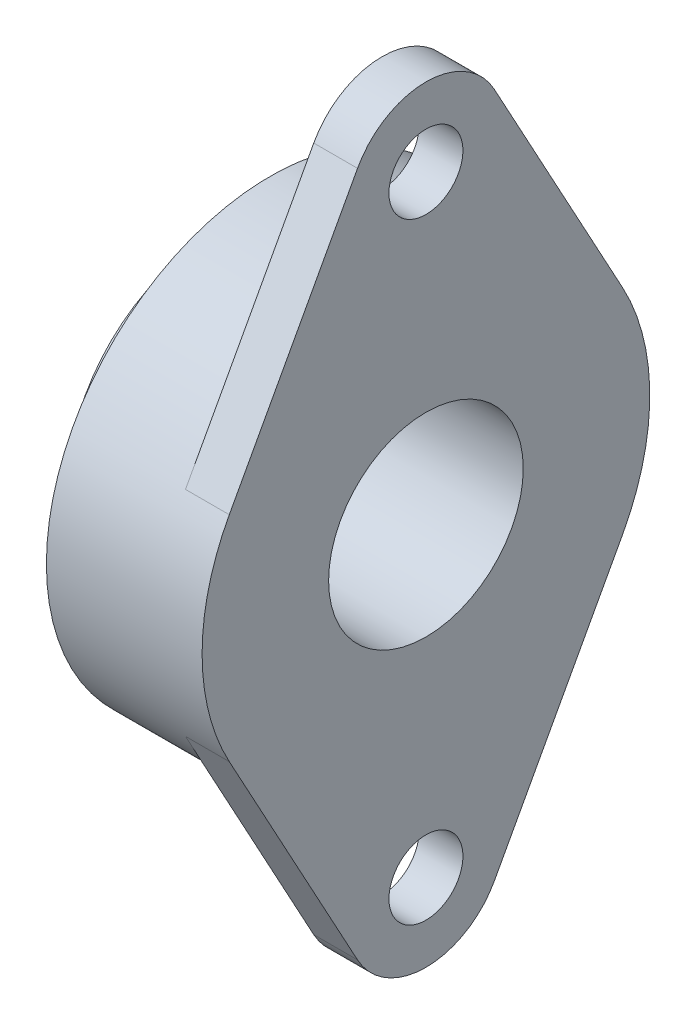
ISO-10303-21;
HEADER;
FILE_DESCRIPTION(('STEP AP214'),'2;1');
FILE_NAME('part.step','',(''),(''),'','','');
FILE_SCHEMA(('AUTOMOTIVE_DESIGN { 1 0 10303 214 1 1 1 1 }'));
ENDSEC;
DATA;
#1=APPLICATION_CONTEXT('core data for automotive mechanical design processes');
#2=APPLICATION_PROTOCOL_DEFINITION('international standard','automotive_design',2000,#1);
#3=PRODUCT_CONTEXT('',#1,'mechanical');
#4=PRODUCT('Part','Part','',(#3));
#5=PRODUCT_RELATED_PRODUCT_CATEGORY('part','',(#4));
#6=PRODUCT_DEFINITION_FORMATION('','',#4);
#7=PRODUCT_DEFINITION_CONTEXT('part definition',#1,'design');
#8=PRODUCT_DEFINITION('design','',#6,#7);
#9=PRODUCT_DEFINITION_SHAPE('','',#8);
#10=(LENGTH_UNIT() NAMED_UNIT(*) SI_UNIT(.MILLI.,.METRE.));
#11=(NAMED_UNIT(*) PLANE_ANGLE_UNIT() SI_UNIT($,.RADIAN.));
#12=(NAMED_UNIT(*) SI_UNIT($,.STERADIAN.) SOLID_ANGLE_UNIT());
#13=UNCERTAINTY_MEASURE_WITH_UNIT(LENGTH_MEASURE(1.E-05),#10,'distance_accuracy_value','');
#14=(GEOMETRIC_REPRESENTATION_CONTEXT(3) GLOBAL_UNCERTAINTY_ASSIGNED_CONTEXT((#13)) GLOBAL_UNIT_ASSIGNED_CONTEXT((#10,
#11,#12)) REPRESENTATION_CONTEXT('',''));
#15=CARTESIAN_POINT('',(0.,0.,0.));
#16=DIRECTION('',(0.,0.,1.));
#17=DIRECTION('',(1.,0.,0.));
#18=AXIS2_PLACEMENT_3D('',#15,#16,#17);
#19=CARTESIAN_POINT('',(-11.25,27.0464439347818,-50.5148550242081));
#20=DIRECTION('',(-1.,0.,0.));
#21=DIRECTION('',(0.,0.,1.));
#22=AXIS2_PLACEMENT_3D('',#19,#20,#21);
#23=PLANE('',#22);
#24=CARTESIAN_POINT('',(-11.25,78.5,0.));
#25=DIRECTION('',(-1.,0.,0.));
#26=DIRECTION('',(0.,0.,1.));
#27=AXIS2_PLACEMENT_3D('',#24,#25,#26);
#28=CIRCLE('',#27,9.49999999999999);
#29=CARTESIAN_POINT('',(-11.25,78.5,9.49999999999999));
#30=VERTEX_POINT('',#29);
#31=EDGE_CURVE('E193',#30,#30,#28,.T.);
#32=ORIENTED_EDGE('',*,*,#31,.F.);
#33=EDGE_LOOP('',(#32));
#34=FACE_BOUND('',#33,.T.);
#35=DIRECTION('',(0.,0.878519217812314,0.477707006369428));
#36=VECTOR('',#35,1.);
#37=CARTESIAN_POINT('',(-11.25,57.7611464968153,-34.0426196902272));
#38=LINE('',#37,#36);
#39=CARTESIAN_POINT('',(-11.25,27.4726083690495,-50.5124321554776));
#40=VERTEX_POINT('',#39);
#41=CARTESIAN_POINT('',(-11.25,88.0541401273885,-17.5703843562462));
#42=VERTEX_POINT('',#41);
#43=EDGE_CURVE('E95',#40,#42,#38,.T.);
#44=ORIENTED_EDGE('',*,*,#43,.F.);
#45=CARTESIAN_POINT('',(-11.25,0.,0.));
#46=DIRECTION('',(-1.,0.,0.));
#47=DIRECTION('',(0.,0.,1.));
#48=AXIS2_PLACEMENT_3D('',#45,#46,#47);
#49=CIRCLE('',#48,57.5);
#50=CARTESIAN_POINT('',(-11.25,27.4726084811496,50.5124320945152));
#51=VERTEX_POINT('',#50);
#52=EDGE_CURVE('E105',#51,#40,#49,.T.);
#53=ORIENTED_EDGE('',*,*,#52,.F.);
#54=DIRECTION('',(0.,-0.878519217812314,0.477707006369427));
#55=VECTOR('',#54,1.);
#56=CARTESIAN_POINT('',(-11.25,57.7611464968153,34.0426196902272));
#57=LINE('',#56,#55);
#58=CARTESIAN_POINT('',(-11.25,88.0541401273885,17.5703843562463));
#59=VERTEX_POINT('',#58);
#60=EDGE_CURVE('E101',#59,#51,#57,.T.);
#61=ORIENTED_EDGE('',*,*,#60,.F.);
#62=CARTESIAN_POINT('',(-11.25,78.5,0.));
#63=DIRECTION('',(1.,0.,0.));
#64=DIRECTION('',(0.,0.,-1.));
#65=AXIS2_PLACEMENT_3D('',#62,#63,#64);
#66=CIRCLE('',#65,20.);
#67=EDGE_CURVE('E103',#42,#59,#66,.T.);
#68=ORIENTED_EDGE('',*,*,#67,.F.);
#69=EDGE_LOOP('',(#44,#53,#61,#68));
#70=FACE_BOUND('',#69,.T.);
#71=ADVANCED_FACE('F16',(#34,#70),#23,.T.);
#72=CARTESIAN_POINT('',(-11.25,-98.9261753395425,-50.5148550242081));
#73=DIRECTION('',(-1.,0.,0.));
#74=DIRECTION('',(0.,0.,1.));
#75=AXIS2_PLACEMENT_3D('',#72,#73,#74);
#76=PLANE('',#75);
#77=CARTESIAN_POINT('',(-11.25,-78.5,0.));
#78=DIRECTION('',(-1.,0.,0.));
#79=DIRECTION('',(0.,0.,1.));
#80=AXIS2_PLACEMENT_3D('',#77,#78,#79);
#81=CIRCLE('',#80,9.49999999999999);
#82=CARTESIAN_POINT('',(-11.25,-78.5,9.49999999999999));
#83=VERTEX_POINT('',#82);
#84=EDGE_CURVE('E190',#83,#83,#81,.T.);
#85=ORIENTED_EDGE('',*,*,#84,.F.);
#86=EDGE_LOOP('',(#85));
#87=FACE_BOUND('',#86,.T.);
#88=DIRECTION('',(0.,0.878519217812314,-0.477707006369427));
#89=VECTOR('',#88,1.);
#90=CARTESIAN_POINT('',(-11.25,-57.7611464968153,-34.0426196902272));
#91=LINE('',#90,#89);
#92=CARTESIAN_POINT('',(-11.25,-88.0541401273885,-17.5703843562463));
#93=VERTEX_POINT('',#92);
#94=CARTESIAN_POINT('',(-11.25,-27.4713263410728,-50.5131293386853));
#95=VERTEX_POINT('',#94);
#96=EDGE_CURVE('E158',#93,#95,#91,.T.);
#97=ORIENTED_EDGE('',*,*,#96,.F.);
#98=CARTESIAN_POINT('',(-11.25,-78.5,0.));
#99=DIRECTION('',(1.,0.,0.));
#100=DIRECTION('',(0.,0.,-1.));
#101=AXIS2_PLACEMENT_3D('',#98,#99,#100);
#102=CIRCLE('',#101,20.);
#103=CARTESIAN_POINT('',(-11.25,-88.0541401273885,17.5703843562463));
#104=VERTEX_POINT('',#103);
#105=EDGE_CURVE('E19',#104,#93,#102,.T.);
#106=ORIENTED_EDGE('',*,*,#105,.F.);
#107=DIRECTION('',(0.,-0.878519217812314,-0.477707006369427));
#108=VECTOR('',#107,1.);
#109=CARTESIAN_POINT('',(-11.25,-57.7611464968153,34.0426196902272));
#110=LINE('',#109,#108);
#111=CARTESIAN_POINT('',(-11.25,-27.4726083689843,50.5124321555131));
#112=VERTEX_POINT('',#111);
#113=EDGE_CURVE('E149',#112,#104,#110,.T.);
#114=ORIENTED_EDGE('',*,*,#113,.F.);
#115=CARTESIAN_POINT('',(-11.25,0.,0.));
#116=DIRECTION('',(-1.,0.,0.));
#117=DIRECTION('',(0.,0.,1.));
#118=AXIS2_PLACEMENT_3D('',#115,#116,#117);
#119=CIRCLE('',#118,57.5);
#120=EDGE_CURVE('E34',#95,#112,#119,.T.);
#121=ORIENTED_EDGE('',*,*,#120,.F.);
#122=EDGE_LOOP('',(#97,#106,#114,#121));
#123=FACE_BOUND('',#122,.T.);
#124=ADVANCED_FACE('F204',(#87,#123),#76,.T.);
#125=CARTESIAN_POINT('',(-40.,-57.5,58.1900021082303));
#126=DIRECTION('',(-1.,0.,0.));
#127=DIRECTION('',(0.,1.,0.));
#128=AXIS2_PLACEMENT_3D('',#125,#126,#127);
#129=PLANE('',#128);
#130=CARTESIAN_POINT('',(-40.,0.,0.));
#131=DIRECTION('',(-1.,0.,0.));
#132=DIRECTION('',(0.,0.,1.));
#133=AXIS2_PLACEMENT_3D('',#130,#131,#132);
#134=CIRCLE('',#133,37.5);
#135=CARTESIAN_POINT('',(-40.,0.,37.5));
#136=VERTEX_POINT('',#135);
#137=EDGE_CURVE('E187',#136,#136,#134,.T.);
#138=ORIENTED_EDGE('',*,*,#137,.F.);
#139=EDGE_LOOP('',(#138));
#140=FACE_BOUND('',#139,.T.);
#141=CARTESIAN_POINT('',(-40.,0.,0.));
#142=DIRECTION('',(-1.,0.,0.));
#143=DIRECTION('',(0.,0.,1.));
#144=AXIS2_PLACEMENT_3D('',#141,#142,#143);
#145=CIRCLE('',#144,57.5);
#146=CARTESIAN_POINT('',(-40.,0.,57.5));
#147=VERTEX_POINT('',#146);
#148=EDGE_CURVE('E121',#147,#147,#145,.F.);
#149=ORIENTED_EDGE('',*,*,#148,.F.);
#150=EDGE_LOOP('',(#149));
#151=FACE_BOUND('',#150,.T.);
#152=ADVANCED_FACE('F287',(#140,#151),#129,.T.);
#153=CARTESIAN_POINT('',(0.,-78.5,0.));
#154=DIRECTION('',(1.,0.,0.));
#155=DIRECTION('',(0.,0.,-1.));
#156=AXIS2_PLACEMENT_3D('',#153,#154,#155);
#157=CYLINDRICAL_SURFACE('',#156,20.);
#158=CARTESIAN_POINT('',(0.,-78.5,0.));
#159=DIRECTION('',(1.,0.,0.));
#160=DIRECTION('',(0.,0.,-1.));
#161=AXIS2_PLACEMENT_3D('',#158,#159,#160);
#162=CIRCLE('',#161,20.);
#163=CARTESIAN_POINT('',(0.,-88.0541401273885,17.5703843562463));
#164=VERTEX_POINT('',#163);
#165=CARTESIAN_POINT('',(0.,-88.0541401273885,-17.5703843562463));
#166=VERTEX_POINT('',#165);
#167=EDGE_CURVE('E184',#164,#166,#162,.T.);
#168=ORIENTED_EDGE('',*,*,#167,.F.);
#169=DIRECTION('',(1.,0.,0.));
#170=VECTOR('',#169,1.);
#171=CARTESIAN_POINT('',(-11.25,-88.0541401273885,17.5703843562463));
#172=LINE('',#171,#170);
#173=EDGE_CURVE('E150',#104,#164,#172,.T.);
#174=ORIENTED_EDGE('',*,*,#173,.F.);
#175=ORIENTED_EDGE('',*,*,#105,.T.);
#176=DIRECTION('',(1.,0.,0.));
#177=VECTOR('',#176,1.);
#178=CARTESIAN_POINT('',(-11.25,-88.0541401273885,-17.5703843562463));
#179=LINE('',#178,#177);
#180=EDGE_CURVE('E141',#166,#93,#179,.F.);
#181=ORIENTED_EDGE('',*,*,#180,.F.);
#182=EDGE_LOOP('',(#168,#174,#175,#181));
#183=FACE_BOUND('',#182,.T.);
#184=ADVANCED_FACE('F207',(#183),#157,.T.);
#185=CARTESIAN_POINT('',(-11.25,-88.0541401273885,-17.5703843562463));
#186=DIRECTION('',(0.,-0.477707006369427,-0.878519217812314));
#187=DIRECTION('',(0.,0.878519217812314,-0.477707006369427));
#188=AXIS2_PLACEMENT_3D('',#185,#186,#187);
#189=PLANE('',#188);
#190=CARTESIAN_POINT('',(0.,-88.0541401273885,-17.5703843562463));
#191=CARTESIAN_POINT('',(0.,-85.5297239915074,-18.943070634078));
#192=CARTESIAN_POINT('',(0.,-83.0053078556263,-20.3157569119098));
#193=CARTESIAN_POINT('',(0.,-77.9564755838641,-23.0611294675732));
#194=CARTESIAN_POINT('',(0.,-75.432059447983,-24.433815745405));
#195=CARTESIAN_POINT('',(0.,-70.3832271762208,-27.1791883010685));
#196=CARTESIAN_POINT('',(0.,-67.8588110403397,-28.5518745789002));
#197=CARTESIAN_POINT('',(0.,-62.8099787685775,-31.2972471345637));
#198=CARTESIAN_POINT('',(0.,-60.2855626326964,-32.6699334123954));
#199=CARTESIAN_POINT('',(0.,-55.2367303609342,-35.4153059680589));
#200=CARTESIAN_POINT('',(0.,-52.7123142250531,-36.7879922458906));
#201=CARTESIAN_POINT('',(0.,-47.6634819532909,-39.5333648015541));
#202=CARTESIAN_POINT('',(0.,-45.1390658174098,-40.9060510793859));
#203=CARTESIAN_POINT('',(0.,-40.0902335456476,-43.6514236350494));
#204=CARTESIAN_POINT('',(0.,-37.5658174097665,-45.0241099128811));
#205=CARTESIAN_POINT('',(0.,-32.5169851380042,-47.7694824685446));
#206=CARTESIAN_POINT('',(0.,-29.9925690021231,-49.1421687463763));
#207=CARTESIAN_POINT('',(0.,-27.468152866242,-50.5148550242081));
#208=B_SPLINE_CURVE_WITH_KNOTS('',3,(#190,#191,#192,#193,#194,#195,#196,#197,#198,#199,#200,
#201,#202,#203,#204,#205,#206,#207),.UNSPECIFIED.,.F.,.F.,(4,2,2,2,2,2,2,2,4),(0.,
8.62046982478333,17.2409396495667,25.86140947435,34.4818792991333,43.1023491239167,
51.7228189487,60.3432887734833,68.9637585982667),.UNSPECIFIED.);
#209=CARTESIAN_POINT('',(0.,-27.468152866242,-50.5148550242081));
#210=VERTEX_POINT('',#209);
#211=EDGE_CURVE('E183',#166,#210,#208,.T.);
#212=ORIENTED_EDGE('',*,*,#211,.F.);
#213=ORIENTED_EDGE('',*,*,#180,.T.);
#214=ORIENTED_EDGE('',*,*,#96,.T.);
#215=CARTESIAN_POINT('',(-11.25,-27.468152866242,-50.5148550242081));
#216=VERTEX_POINT('',#215);
#217=EDGE_CURVE('E144',#95,#216,#91,.T.);
#218=ORIENTED_EDGE('',*,*,#217,.T.);
#219=DIRECTION('',(-1.,0.,0.));
#220=VECTOR('',#219,1.);
#221=CARTESIAN_POINT('',(-20.,-27.468152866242,-50.5148550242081));
#222=LINE('',#221,#220);
#223=EDGE_CURVE('E135',#210,#216,#222,.T.);
#224=ORIENTED_EDGE('',*,*,#223,.F.);
#225=EDGE_LOOP('',(#212,#213,#214,#218,#224));
#226=FACE_BOUND('',#225,.T.);
#227=ADVANCED_FACE('F203',(#226),#189,.T.);
#228=CARTESIAN_POINT('',(-11.25,27.4681528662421,-50.5148550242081));
#229=DIRECTION('',(0.,0.477707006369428,-0.878519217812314));
#230=DIRECTION('',(0.,0.878519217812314,0.477707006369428));
#231=AXIS2_PLACEMENT_3D('',#228,#229,#230);
#232=PLANE('',#231);
#233=CARTESIAN_POINT('',(0.,27.4681528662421,-50.514855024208));
#234=CARTESIAN_POINT('',(0.,29.9925690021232,-49.1421687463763));
#235=CARTESIAN_POINT('',(0.,32.5169851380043,-47.7694824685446));
#236=CARTESIAN_POINT('',(0.,37.5658174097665,-45.0241099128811));
#237=CARTESIAN_POINT('',(0.,40.0902335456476,-43.6514236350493));
#238=CARTESIAN_POINT('',(0.,45.1390658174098,-40.9060510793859));
#239=CARTESIAN_POINT('',(0.,47.6634819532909,-39.5333648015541));
#240=CARTESIAN_POINT('',(0.,52.7123142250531,-36.7879922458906));
#241=CARTESIAN_POINT('',(0.,55.2367303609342,-35.4153059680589));
#242=CARTESIAN_POINT('',(0.,60.2855626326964,-32.6699334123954));
#243=CARTESIAN_POINT('',(0.,62.8099787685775,-31.2972471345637));
#244=CARTESIAN_POINT('',(0.,67.8588110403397,-28.5518745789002));
#245=CARTESIAN_POINT('',(0.,70.3832271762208,-27.1791883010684));
#246=CARTESIAN_POINT('',(0.,75.432059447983,-24.433815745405));
#247=CARTESIAN_POINT('',(0.,77.9564755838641,-23.0611294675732));
#248=CARTESIAN_POINT('',(0.,83.0053078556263,-20.3157569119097));
#249=CARTESIAN_POINT('',(0.,85.5297239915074,-18.943070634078));
#250=CARTESIAN_POINT('',(0.,88.0541401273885,-17.5703843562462));
#251=B_SPLINE_CURVE_WITH_KNOTS('',3,(#233,#234,#235,#236,#237,#238,#239,#240,#241,#242,#243,
#244,#245,#246,#247,#248,#249,#250),.UNSPECIFIED.,.F.,.F.,(4,2,2,2,2,2,2,2,4),(0.,
8.62046982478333,17.2409396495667,25.86140947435,34.4818792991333,43.1023491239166,
51.7228189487,60.3432887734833,68.9637585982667),.UNSPECIFIED.);
#252=CARTESIAN_POINT('',(0.,27.4681528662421,-50.5148550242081));
#253=VERTEX_POINT('',#252);
#254=CARTESIAN_POINT('',(0.,88.0541401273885,-17.5703843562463));
#255=VERTEX_POINT('',#254);
#256=EDGE_CURVE('E179',#253,#255,#251,.T.);
#257=ORIENTED_EDGE('',*,*,#256,.F.);
#258=DIRECTION('',(1.,0.,0.));
#259=VECTOR('',#258,1.);
#260=CARTESIAN_POINT('',(-11.25,27.4681528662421,-50.5148550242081));
#261=LINE('',#260,#259);
#262=CARTESIAN_POINT('',(-11.25,27.4681528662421,-50.514855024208));
#263=VERTEX_POINT('',#262);
#264=EDGE_CURVE('E116',#253,#263,#261,.F.);
#265=ORIENTED_EDGE('',*,*,#264,.T.);
#266=CARTESIAN_POINT('',(-11.25,0.,0.));
#267=DIRECTION('',(-1.,0.,0.));
#268=DIRECTION('',(0.,1.,0.));
#269=AXIS2_PLACEMENT_3D('',#266,#267,#268);
#270=CIRCLE('',#269,57.5);
#271=EDGE_CURVE('E138',#40,#263,#270,.T.);
#272=ORIENTED_EDGE('',*,*,#271,.F.);
#273=ORIENTED_EDGE('',*,*,#43,.T.);
#274=DIRECTION('',(-1.,0.,0.));
#275=VECTOR('',#274,1.);
#276=CARTESIAN_POINT('',(-5.62499999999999,88.0541401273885,-17.5703843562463));
#277=LINE('',#276,#275);
#278=EDGE_CURVE('E109',#255,#42,#277,.T.);
#279=ORIENTED_EDGE('',*,*,#278,.F.);
#280=EDGE_LOOP('',(#257,#265,#272,#273,#279));
#281=FACE_BOUND('',#280,.T.);
#282=ADVANCED_FACE('F259',(#281),#232,.T.);
#283=CARTESIAN_POINT('',(0.,78.5,0.));
#284=DIRECTION('',(1.,0.,0.));
#285=DIRECTION('',(0.,0.,-1.));
#286=AXIS2_PLACEMENT_3D('',#283,#284,#285);
#287=CYLINDRICAL_SURFACE('',#286,20.);
#288=CARTESIAN_POINT('',(0.,78.5,0.));
#289=DIRECTION('',(1.,0.,0.));
#290=DIRECTION('',(0.,0.,-1.));
#291=AXIS2_PLACEMENT_3D('',#288,#289,#290);
#292=CIRCLE('',#291,20.);
#293=CARTESIAN_POINT('',(0.,88.0541401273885,17.5703843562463));
#294=VERTEX_POINT('',#293);
#295=EDGE_CURVE('E177',#255,#294,#292,.T.);
#296=ORIENTED_EDGE('',*,*,#295,.F.);
#297=ORIENTED_EDGE('',*,*,#278,.T.);
#298=ORIENTED_EDGE('',*,*,#67,.T.);
#299=DIRECTION('',(1.,0.,0.));
#300=VECTOR('',#299,1.);
#301=CARTESIAN_POINT('',(-11.25,88.0541401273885,17.5703843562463));
#302=LINE('',#301,#300);
#303=EDGE_CURVE('E114',#294,#59,#302,.F.);
#304=ORIENTED_EDGE('',*,*,#303,.F.);
#305=EDGE_LOOP('',(#296,#297,#298,#304));
#306=FACE_BOUND('',#305,.T.);
#307=ADVANCED_FACE('F113',(#306),#287,.T.);
#308=CARTESIAN_POINT('',(-11.25,88.0541401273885,17.5703843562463));
#309=DIRECTION('',(0.,0.477707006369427,0.878519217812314));
#310=DIRECTION('',(0.,-0.878519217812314,0.477707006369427));
#311=AXIS2_PLACEMENT_3D('',#308,#309,#310);
#312=PLANE('',#311);
#313=CARTESIAN_POINT('',(0.,88.0541401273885,17.5703843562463));
#314=CARTESIAN_POINT('',(0.,85.5297239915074,18.943070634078));
#315=CARTESIAN_POINT('',(0.,83.0053078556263,20.3157569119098));
#316=CARTESIAN_POINT('',(0.,77.9564755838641,23.0611294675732));
#317=CARTESIAN_POINT('',(0.,75.432059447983,24.433815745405));
#318=CARTESIAN_POINT('',(0.,70.3832271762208,27.1791883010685));
#319=CARTESIAN_POINT('',(0.,67.8588110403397,28.5518745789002));
#320=CARTESIAN_POINT('',(0.,62.8099787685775,31.2972471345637));
#321=CARTESIAN_POINT('',(0.,60.2855626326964,32.6699334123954));
#322=CARTESIAN_POINT('',(0.,55.2367303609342,35.4153059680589));
#323=CARTESIAN_POINT('',(0.,52.7123142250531,36.7879922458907));
#324=CARTESIAN_POINT('',(0.,47.6634819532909,39.5333648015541));
#325=CARTESIAN_POINT('',(0.,45.1390658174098,40.9060510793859));
#326=CARTESIAN_POINT('',(0.,40.0902335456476,43.6514236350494));
#327=CARTESIAN_POINT('',(0.,37.5658174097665,45.0241099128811));
#328=CARTESIAN_POINT('',(0.,32.5169851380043,47.7694824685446));
#329=CARTESIAN_POINT('',(0.,29.9925690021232,49.1421687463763));
#330=CARTESIAN_POINT('',(0.,27.4681528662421,50.5148550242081));
#331=B_SPLINE_CURVE_WITH_KNOTS('',3,(#313,#314,#315,#316,#317,#318,#319,#320,#321,#322,#323,
#324,#325,#326,#327,#328,#329,#330),.UNSPECIFIED.,.F.,.F.,(4,2,2,2,2,2,2,2,4),(0.,
8.62046982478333,17.2409396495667,25.86140947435,34.4818792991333,43.1023491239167,
51.7228189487,60.3432887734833,68.9637585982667),.UNSPECIFIED.);
#332=CARTESIAN_POINT('',(0.,27.468152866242,50.5148550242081));
#333=VERTEX_POINT('',#332);
#334=EDGE_CURVE('E119',#294,#333,#331,.T.);
#335=ORIENTED_EDGE('',*,*,#334,.F.);
#336=ORIENTED_EDGE('',*,*,#303,.T.);
#337=ORIENTED_EDGE('',*,*,#60,.T.);
#338=CARTESIAN_POINT('',(-11.25,27.468152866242,50.5148550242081));
#339=VERTEX_POINT('',#338);
#340=EDGE_CURVE('E108',#51,#339,#57,.T.);
#341=ORIENTED_EDGE('',*,*,#340,.T.);
#342=DIRECTION('',(-1.,0.,0.));
#343=VECTOR('',#342,1.);
#344=CARTESIAN_POINT('',(-20.,27.468152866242,50.5148550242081));
#345=LINE('',#344,#343);
#346=EDGE_CURVE('E146',#333,#339,#345,.T.);
#347=ORIENTED_EDGE('',*,*,#346,.F.);
#348=EDGE_LOOP('',(#335,#336,#337,#341,#347));
#349=FACE_BOUND('',#348,.T.);
#350=ADVANCED_FACE('F117',(#349),#312,.T.);
#351=CARTESIAN_POINT('',(-40.,0.,0.));
#352=DIRECTION('',(-1.,0.,0.));
#353=DIRECTION('',(0.,0.,1.));
#354=AXIS2_PLACEMENT_3D('',#351,#352,#353);
#355=CYLINDRICAL_SURFACE('',#354,57.5);
#356=ORIENTED_EDGE('',*,*,#148,.T.);
#357=EDGE_LOOP('',(#356));
#358=FACE_BOUND('',#357,.T.);
#359=ORIENTED_EDGE('',*,*,#346,.T.);
#360=ORIENTED_EDGE('',*,*,#340,.F.);
#361=ORIENTED_EDGE('',*,*,#52,.T.);
#362=ORIENTED_EDGE('',*,*,#271,.T.);
#363=ORIENTED_EDGE('',*,*,#264,.F.);
#364=CARTESIAN_POINT('',(0.,0.,0.));
#365=DIRECTION('',(-1.,0.,0.));
#366=DIRECTION('',(0.,0.,1.));
#367=AXIS2_PLACEMENT_3D('',#364,#365,#366);
#368=CIRCLE('',#367,57.5);
#369=EDGE_CURVE('E180',#210,#253,#368,.F.);
#370=ORIENTED_EDGE('',*,*,#369,.F.);
#371=ORIENTED_EDGE('',*,*,#223,.T.);
#372=ORIENTED_EDGE('',*,*,#217,.F.);
#373=ORIENTED_EDGE('',*,*,#120,.T.);
#374=CARTESIAN_POINT('',(-11.25,0.,0.));
#375=DIRECTION('',(-1.,0.,0.));
#376=DIRECTION('',(0.,1.,0.));
#377=AXIS2_PLACEMENT_3D('',#374,#375,#376);
#378=CIRCLE('',#377,57.5);
#379=CARTESIAN_POINT('',(-11.25,-27.468152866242,50.5148550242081));
#380=VERTEX_POINT('',#379);
#381=EDGE_CURVE('E57',#112,#380,#378,.T.);
#382=ORIENTED_EDGE('',*,*,#381,.T.);
#383=DIRECTION('',(1.,0.,0.));
#384=VECTOR('',#383,1.);
#385=CARTESIAN_POINT('',(-11.25,-27.468152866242,50.5148550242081));
#386=LINE('',#385,#384);
#387=CARTESIAN_POINT('',(0.,-27.468152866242,50.5148550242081));
#388=VERTEX_POINT('',#387);
#389=EDGE_CURVE('E196',#388,#380,#386,.F.);
#390=ORIENTED_EDGE('',*,*,#389,.F.);
#391=CARTESIAN_POINT('',(0.,0.,0.));
#392=DIRECTION('',(-1.,0.,0.));
#393=DIRECTION('',(0.,0.,1.));
#394=AXIS2_PLACEMENT_3D('',#391,#392,#393);
#395=CIRCLE('',#394,57.5);
#396=EDGE_CURVE('E174',#333,#388,#395,.F.);
#397=ORIENTED_EDGE('',*,*,#396,.F.);
#398=EDGE_LOOP('',(#359,#360,#361,#362,#363,#370,#371,#372,#373,#382,#390,#397));
#399=FACE_BOUND('',#398,.T.);
#400=ADVANCED_FACE('F199',(#358,#399),#355,.T.);
#401=CARTESIAN_POINT('',(-11.25,-27.468152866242,50.5148550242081));
#402=DIRECTION('',(0.,-0.477707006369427,0.878519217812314));
#403=DIRECTION('',(0.,-0.878519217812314,-0.477707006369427));
#404=AXIS2_PLACEMENT_3D('',#401,#402,#403);
#405=PLANE('',#404);
#406=CARTESIAN_POINT('',(0.,-27.468152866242,50.5148550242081));
#407=CARTESIAN_POINT('',(0.,-29.9925690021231,49.1421687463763));
#408=CARTESIAN_POINT('',(0.,-32.5169851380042,47.7694824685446));
#409=CARTESIAN_POINT('',(0.,-37.5658174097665,45.0241099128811));
#410=CARTESIAN_POINT('',(0.,-40.0902335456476,43.6514236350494));
#411=CARTESIAN_POINT('',(0.,-45.1390658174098,40.9060510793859));
#412=CARTESIAN_POINT('',(0.,-47.6634819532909,39.5333648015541));
#413=CARTESIAN_POINT('',(0.,-52.7123142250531,36.7879922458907));
#414=CARTESIAN_POINT('',(0.,-55.2367303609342,35.4153059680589));
#415=CARTESIAN_POINT('',(0.,-60.2855626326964,32.6699334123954));
#416=CARTESIAN_POINT('',(0.,-62.8099787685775,31.2972471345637));
#417=CARTESIAN_POINT('',(0.,-67.8588110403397,28.5518745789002));
#418=CARTESIAN_POINT('',(0.,-70.3832271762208,27.1791883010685));
#419=CARTESIAN_POINT('',(0.,-75.432059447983,24.433815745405));
#420=CARTESIAN_POINT('',(0.,-77.9564755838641,23.0611294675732));
#421=CARTESIAN_POINT('',(0.,-83.0053078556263,20.3157569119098));
#422=CARTESIAN_POINT('',(0.,-85.5297239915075,18.943070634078));
#423=CARTESIAN_POINT('',(0.,-88.0541401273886,17.5703843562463));
#424=B_SPLINE_CURVE_WITH_KNOTS('',3,(#406,#407,#408,#409,#410,#411,#412,#413,#414,#415,#416,
#417,#418,#419,#420,#421,#422,#423),.UNSPECIFIED.,.F.,.F.,(4,2,2,2,2,2,2,2,4),(0.,
8.62046982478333,17.2409396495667,25.86140947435,34.4818792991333,43.1023491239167,
51.7228189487,60.3432887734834,68.9637585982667),.UNSPECIFIED.);
#425=EDGE_CURVE('E173',#388,#164,#424,.T.);
#426=ORIENTED_EDGE('',*,*,#425,.F.);
#427=ORIENTED_EDGE('',*,*,#389,.T.);
#428=ORIENTED_EDGE('',*,*,#381,.F.);
#429=ORIENTED_EDGE('',*,*,#113,.T.);
#430=ORIENTED_EDGE('',*,*,#173,.T.);
#431=EDGE_LOOP('',(#426,#427,#428,#429,#430));
#432=FACE_BOUND('',#431,.T.);
#433=ADVANCED_FACE('F294',(#432),#405,.T.);
#434=CARTESIAN_POINT('',(0.,78.5,0.));
#435=DIRECTION('',(-1.,0.,0.));
#436=DIRECTION('',(0.,0.,1.));
#437=AXIS2_PLACEMENT_3D('',#434,#435,#436);
#438=CYLINDRICAL_SURFACE('',#437,9.49999999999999);
#439=CARTESIAN_POINT('',(0.,78.5,0.));
#440=DIRECTION('',(-1.,0.,0.));
#441=DIRECTION('',(0.,0.,1.));
#442=AXIS2_PLACEMENT_3D('',#439,#440,#441);
#443=CIRCLE('',#442,9.49999999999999);
#444=CARTESIAN_POINT('',(0.,78.5,9.49999999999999));
#445=VERTEX_POINT('',#444);
#446=EDGE_CURVE('E170',#445,#445,#443,.T.);
#447=ORIENTED_EDGE('',*,*,#446,.F.);
#448=EDGE_LOOP('',(#447));
#449=FACE_BOUND('',#448,.T.);
#450=ORIENTED_EDGE('',*,*,#31,.T.);
#451=EDGE_LOOP('',(#450));
#452=FACE_BOUND('',#451,.T.);
#453=ADVANCED_FACE('F300',(#449,#452),#438,.F.);
#454=CARTESIAN_POINT('',(0.,-78.5,0.));
#455=DIRECTION('',(-1.,0.,0.));
#456=DIRECTION('',(0.,0.,1.));
#457=AXIS2_PLACEMENT_3D('',#454,#455,#456);
#458=CYLINDRICAL_SURFACE('',#457,9.49999999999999);
#459=CARTESIAN_POINT('',(0.,-78.5,0.));
#460=DIRECTION('',(-1.,0.,0.));
#461=DIRECTION('',(0.,0.,1.));
#462=AXIS2_PLACEMENT_3D('',#459,#460,#461);
#463=CIRCLE('',#462,9.49999999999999);
#464=CARTESIAN_POINT('',(0.,-78.5,9.49999999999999));
#465=VERTEX_POINT('',#464);
#466=EDGE_CURVE('E167',#465,#465,#463,.T.);
#467=ORIENTED_EDGE('',*,*,#466,.F.);
#468=EDGE_LOOP('',(#467));
#469=FACE_BOUND('',#468,.T.);
#470=ORIENTED_EDGE('',*,*,#84,.T.);
#471=EDGE_LOOP('',(#470));
#472=FACE_BOUND('',#471,.T.);
#473=ADVANCED_FACE('F284',(#469,#472),#458,.F.);
#474=CARTESIAN_POINT('',(-54.6,0.,0.));
#475=DIRECTION('',(-1.,0.,0.));
#476=DIRECTION('',(0.,0.,1.));
#477=AXIS2_PLACEMENT_3D('',#474,#475,#476);
#478=CYLINDRICAL_SURFACE('',#477,37.5);
#479=CARTESIAN_POINT('',(-54.6,0.,0.));
#480=DIRECTION('',(-1.,0.,0.));
#481=DIRECTION('',(0.,0.,1.));
#482=AXIS2_PLACEMENT_3D('',#479,#480,#481);
#483=CIRCLE('',#482,37.5);
#484=CARTESIAN_POINT('',(-54.6,0.,37.5));
#485=VERTEX_POINT('',#484);
#486=EDGE_CURVE('E164',#485,#485,#483,.T.);
#487=ORIENTED_EDGE('',*,*,#486,.F.);
#488=EDGE_LOOP('',(#487));
#489=FACE_BOUND('',#488,.T.);
#490=ORIENTED_EDGE('',*,*,#137,.T.);
#491=EDGE_LOOP('',(#490));
#492=FACE_BOUND('',#491,.T.);
#493=ADVANCED_FACE('F239',(#489,#492),#478,.T.);
#494=CARTESIAN_POINT('',(0.,100.4897,57.5));
#495=CARTESIAN_POINT('',(0.,98.5,57.5));
#496=CARTESIAN_POINT('',(0.,-98.5,57.5000000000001));
#497=CARTESIAN_POINT('',(0.,-100.47,57.5000000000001));
#498=B_SPLINE_CURVE_WITH_KNOTS('',1,(#494,#495,#496,#497),.UNSPECIFIED.,.F.,.F.,(2,1,1,2),
(-0.0101,0.,1.,1.01),.UNSPECIFIED.);
#499=DIRECTION('',(0.,0.,-1.));
#500=VECTOR('',#499,1.);
#501=SURFACE_OF_LINEAR_EXTRUSION('',#498,#500);
#502=CARTESIAN_POINT('',(0.,0.,0.));
#503=DIRECTION('',(-1.,0.,0.));
#504=DIRECTION('',(0.,0.,1.));
#505=AXIS2_PLACEMENT_3D('',#502,#503,#504);
#506=CIRCLE('',#505,25.);
#507=CARTESIAN_POINT('',(0.,0.,25.));
#508=VERTEX_POINT('',#507);
#509=EDGE_CURVE('E25',#508,#508,#506,.F.);
#510=ORIENTED_EDGE('',*,*,#509,.F.);
#511=EDGE_LOOP('',(#510));
#512=FACE_BOUND('',#511,.T.);
#513=ORIENTED_EDGE('',*,*,#466,.T.);
#514=EDGE_LOOP('',(#513));
#515=FACE_BOUND('',#514,.T.);
#516=ORIENTED_EDGE('',*,*,#446,.T.);
#517=EDGE_LOOP('',(#516));
#518=FACE_BOUND('',#517,.T.);
#519=ORIENTED_EDGE('',*,*,#396,.T.);
#520=ORIENTED_EDGE('',*,*,#425,.T.);
#521=ORIENTED_EDGE('',*,*,#167,.T.);
#522=ORIENTED_EDGE('',*,*,#211,.T.);
#523=ORIENTED_EDGE('',*,*,#369,.T.);
#524=ORIENTED_EDGE('',*,*,#256,.T.);
#525=ORIENTED_EDGE('',*,*,#295,.T.);
#526=ORIENTED_EDGE('',*,*,#334,.T.);
#527=EDGE_LOOP('',(#519,#520,#521,#522,#523,#524,#525,#526));
#528=FACE_BOUND('',#527,.T.);
#529=ADVANCED_FACE('F218',(#512,#515,#518,#528),#501,.T.);
#530=CARTESIAN_POINT('',(-54.6,-37.5,37.9500021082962));
#531=DIRECTION('',(-1.,0.,0.));
#532=DIRECTION('',(0.,1.,0.));
#533=AXIS2_PLACEMENT_3D('',#530,#531,#532);
#534=PLANE('',#533);
#535=CARTESIAN_POINT('',(-54.6,0.,0.));
#536=DIRECTION('',(-1.,0.,0.));
#537=DIRECTION('',(0.,0.,1.));
#538=AXIS2_PLACEMENT_3D('',#535,#536,#537);
#539=CIRCLE('',#538,25.);
#540=CARTESIAN_POINT('',(-54.6,0.,25.));
#541=VERTEX_POINT('',#540);
#542=EDGE_CURVE('E10',#541,#541,#539,.T.);
#543=ORIENTED_EDGE('',*,*,#542,.F.);
#544=EDGE_LOOP('',(#543));
#545=FACE_BOUND('',#544,.T.);
#546=ORIENTED_EDGE('',*,*,#486,.T.);
#547=EDGE_LOOP('',(#546));
#548=FACE_BOUND('',#547,.T.);
#549=ADVANCED_FACE('F238',(#545,#548),#534,.T.);
#550=CARTESIAN_POINT('',(0.,0.,0.));
#551=DIRECTION('',(-1.,0.,0.));
#552=DIRECTION('',(0.,0.,1.));
#553=AXIS2_PLACEMENT_3D('',#550,#551,#552);
#554=CYLINDRICAL_SURFACE('',#553,25.);
#555=ORIENTED_EDGE('',*,*,#509,.T.);
#556=EDGE_LOOP('',(#555));
#557=FACE_BOUND('',#556,.T.);
#558=ORIENTED_EDGE('',*,*,#542,.T.);
#559=EDGE_LOOP('',(#558));
#560=FACE_BOUND('',#559,.T.);
#561=ADVANCED_FACE('F269',(#557,#560),#554,.F.);
#562=CLOSED_SHELL('',(#71,#124,#152,#184,#227,#282,#307,#350,#400,#433,#453,#473,#493,#529,#549,#561));
#563=MANIFOLD_SOLID_BREP('B1',#562);
#564=ADVANCED_BREP_SHAPE_REPRESENTATION('',(#18,#563),#14);
#565=SHAPE_DEFINITION_REPRESENTATION(#9,#564);
ENDSEC;
END-ISO-10303-21;
